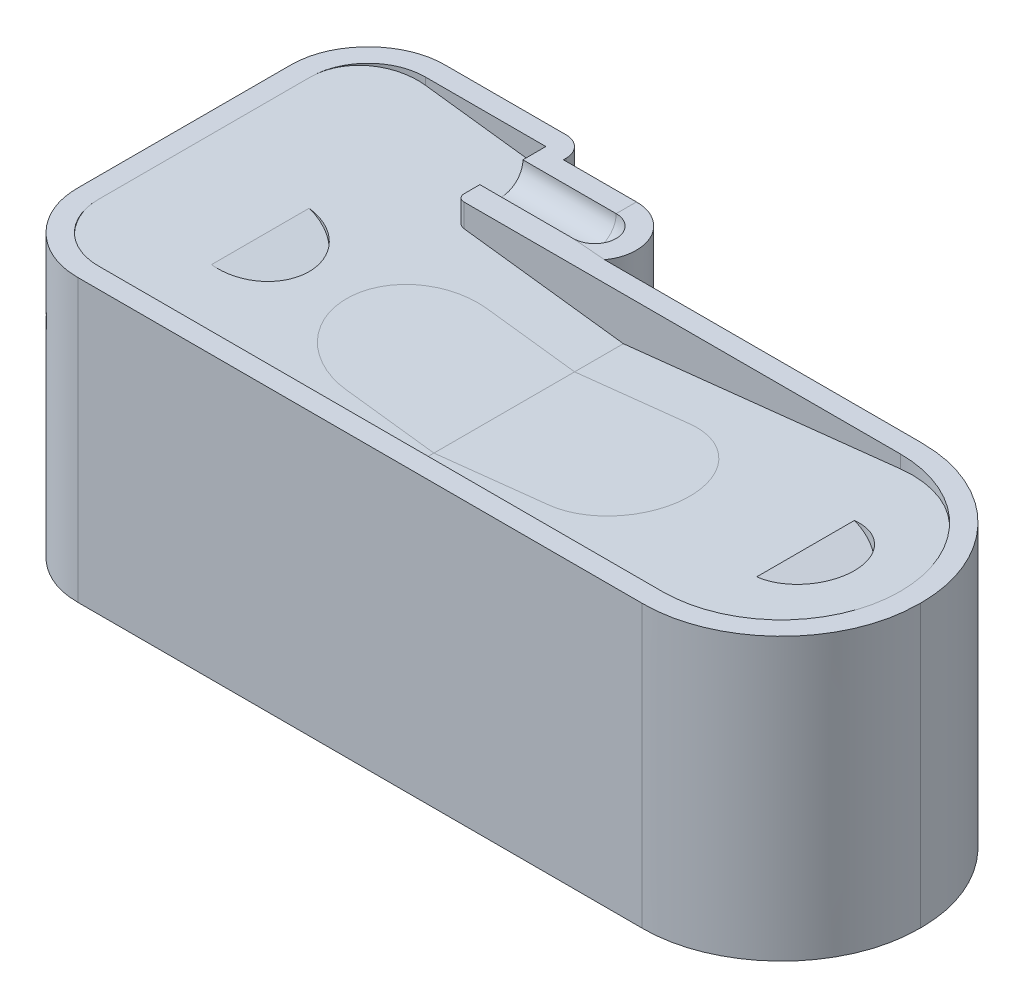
ISO-10303-21;
HEADER;
FILE_DESCRIPTION(('STEP AP214'),'2;1');
FILE_NAME('part.step','',(''),(''),'','','');
FILE_SCHEMA(('AUTOMOTIVE_DESIGN { 1 0 10303 214 1 1 1 1 }'));
ENDSEC;
DATA;
#1=APPLICATION_CONTEXT('core data for automotive mechanical design processes');
#2=APPLICATION_PROTOCOL_DEFINITION('international standard','automotive_design',2000,#1);
#3=PRODUCT_CONTEXT('',#1,'mechanical');
#4=PRODUCT('Part','Part','',(#3));
#5=PRODUCT_RELATED_PRODUCT_CATEGORY('part','',(#4));
#6=PRODUCT_DEFINITION_FORMATION('','',#4);
#7=PRODUCT_DEFINITION_CONTEXT('part definition',#1,'design');
#8=PRODUCT_DEFINITION('design','',#6,#7);
#9=PRODUCT_DEFINITION_SHAPE('','',#8);
#10=(LENGTH_UNIT() NAMED_UNIT(*) SI_UNIT(.MILLI.,.METRE.));
#11=(NAMED_UNIT(*) PLANE_ANGLE_UNIT() SI_UNIT($,.RADIAN.));
#12=(NAMED_UNIT(*) SI_UNIT($,.STERADIAN.) SOLID_ANGLE_UNIT());
#13=UNCERTAINTY_MEASURE_WITH_UNIT(LENGTH_MEASURE(1.E-05),#10,'distance_accuracy_value','');
#14=(GEOMETRIC_REPRESENTATION_CONTEXT(3) GLOBAL_UNCERTAINTY_ASSIGNED_CONTEXT((#13)) GLOBAL_UNIT_ASSIGNED_CONTEXT((#10,
#11,#12)) REPRESENTATION_CONTEXT('',''));
#15=CARTESIAN_POINT('',(0.,0.,0.));
#16=DIRECTION('',(0.,0.,1.));
#17=DIRECTION('',(1.,0.,0.));
#18=AXIS2_PLACEMENT_3D('',#15,#16,#17);
#19=CARTESIAN_POINT('',(-12.444,10.,-7.299));
#20=CARTESIAN_POINT('',(-12.3743071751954,10.,-7.29617606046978));
#21=CARTESIAN_POINT('',(-11.8325128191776,10.,-7.27422265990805));
#22=CARTESIAN_POINT('',(-11.3402534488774,10.,-6.91423830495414));
#23=CARTESIAN_POINT('',(-10.9064674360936,10.,-6.07209550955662));
#24=CARTESIAN_POINT('',(-10.9007100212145,10.,-5.46221551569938));
#25=CARTESIAN_POINT('',(-11.1977209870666,10.,-5.00866481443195));
#26=CARTESIAN_POINT('',(-11.2341734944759,10.,-4.953));
#27=B_SPLINE_CURVE_WITH_KNOTS('',3,(#19,#20,#21,#22,#23,#24,#25,#26),.UNSPECIFIED.,.F.,.F.,(4,1,
2,1,4),(0.,0.0643166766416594,0.5,0.938634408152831,1.),.UNSPECIFIED.);
#28=DIRECTION('',(0.,-1.,0.));
#29=VECTOR('',#28,1.);
#30=SURFACE_OF_LINEAR_EXTRUSION('',#27,#29);
#31=DIRECTION('',(0.,-1.,0.));
#32=VECTOR('',#31,1.);
#33=CARTESIAN_POINT('',(-12.444,10.,-7.299));
#34=LINE('',#33,#32);
#35=CARTESIAN_POINT('',(-12.444,0.,-7.299));
#36=VERTEX_POINT('',#35);
#37=CARTESIAN_POINT('',(-12.444,-10.,-7.299));
#38=VERTEX_POINT('',#37);
#39=EDGE_CURVE('E199',#36,#38,#34,.T.);
#40=ORIENTED_EDGE('',*,*,#39,.F.);
#41=CARTESIAN_POINT('',(-12.444,0.,-7.299));
#42=CARTESIAN_POINT('',(-12.3743071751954,0.,-7.29617606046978));
#43=CARTESIAN_POINT('',(-11.8325128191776,0.,-7.27422265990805));
#44=CARTESIAN_POINT('',(-11.3402534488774,0.,-6.91423830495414));
#45=CARTESIAN_POINT('',(-10.9064674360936,0.,-6.07209550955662));
#46=CARTESIAN_POINT('',(-10.9007100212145,0.,-5.46221551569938));
#47=CARTESIAN_POINT('',(-11.1977209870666,0.,-5.00866481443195));
#48=CARTESIAN_POINT('',(-11.2341734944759,0.,-4.953));
#49=B_SPLINE_CURVE_WITH_KNOTS('',3,(#41,#42,#43,#44,#45,#46,#47,#48),.UNSPECIFIED.,.F.,.F.,(4,1,
2,1,4),(0.,0.0643166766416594,0.5,0.938634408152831,1.),.UNSPECIFIED.);
#50=CARTESIAN_POINT('',(-11.2341734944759,0.,-4.953));
#51=VERTEX_POINT('',#50);
#52=EDGE_CURVE('E216',#36,#51,#49,.T.);
#53=ORIENTED_EDGE('',*,*,#52,.T.);
#54=DIRECTION('',(0.,-1.,0.));
#55=VECTOR('',#54,1.);
#56=CARTESIAN_POINT('',(-11.2341734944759,10.,-4.953));
#57=LINE('',#56,#55);
#58=CARTESIAN_POINT('',(-11.2341734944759,-10.,-4.953));
#59=VERTEX_POINT('',#58);
#60=EDGE_CURVE('E192',#51,#59,#57,.T.);
#61=ORIENTED_EDGE('',*,*,#60,.T.);
#62=CARTESIAN_POINT('',(-11.2341734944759,-10.,-4.953));
#63=CARTESIAN_POINT('',(-11.1977209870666,-10.,-5.00866481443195));
#64=CARTESIAN_POINT('',(-10.9007100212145,-10.,-5.46221551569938));
#65=CARTESIAN_POINT('',(-10.9064674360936,-10.,-6.07209550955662));
#66=CARTESIAN_POINT('',(-11.3402534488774,-10.,-6.91423830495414));
#67=CARTESIAN_POINT('',(-11.8325128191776,-10.,-7.27422265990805));
#68=CARTESIAN_POINT('',(-12.3743071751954,-10.,-7.29617606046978));
#69=CARTESIAN_POINT('',(-12.444,-10.,-7.299));
#70=B_SPLINE_CURVE_WITH_KNOTS('',3,(#62,#63,#64,#65,#66,#67,#68,#69),.UNSPECIFIED.,.F.,.F.,(4,1,
2,1,4),(0.,0.0613655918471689,0.5,0.935683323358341,1.),.UNSPECIFIED.);
#71=EDGE_CURVE('E519',#38,#59,#70,.F.);
#72=ORIENTED_EDGE('',*,*,#71,.F.);
#73=EDGE_LOOP('',(#40,#53,#61,#72));
#74=FACE_BOUND('',#73,.T.);
#75=ADVANCED_FACE('F30',(#74),#30,.T.);
#76=CARTESIAN_POINT('',(-15.759,10.,-8.115));
#77=CARTESIAN_POINT('',(-15.7342948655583,10.,-8.11427988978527));
#78=CARTESIAN_POINT('',(-15.6853493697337,10.,-8.11285321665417));
#79=CARTESIAN_POINT('',(-15.6132718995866,10.,-8.10137302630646));
#80=CARTESIAN_POINT('',(-15.543733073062,10.,-8.08347971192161));
#81=CARTESIAN_POINT('',(-15.477101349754,10.,-8.05889167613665));
#82=CARTESIAN_POINT('',(-15.4137434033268,10.,-8.02815731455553));
#83=CARTESIAN_POINT('',(-15.3540245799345,10.,-7.99160457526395));
#84=CARTESIAN_POINT('',(-15.298679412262,10.,-7.94989532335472));
#85=CARTESIAN_POINT('',(-15.2479761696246,10.,-7.90351662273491));
#86=CARTESIAN_POINT('',(-15.2021554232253,10.,-7.85292978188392));
#87=CARTESIAN_POINT('',(-15.1612211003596,10.,-7.79816536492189));
#88=CARTESIAN_POINT('',(-15.1252995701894,10.,-7.73920969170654));
#89=CARTESIAN_POINT('',(-15.0948716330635,10.,-7.67632949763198));
#90=CARTESIAN_POINT('',(-15.0703861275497,10.,-7.60982039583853));
#91=CARTESIAN_POINT('',(-15.0525684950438,10.,-7.54041928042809));
#92=CARTESIAN_POINT('',(-15.0411375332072,10.,-7.46849234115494));
#93=CARTESIAN_POINT('',(-15.0397169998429,10.,-7.41965177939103));
#94=CARTESIAN_POINT('',(-15.039,10.,-7.395));
#95=B_SPLINE_CURVE_WITH_KNOTS('',3,(#76,#77,#78,#79,#80,#81,#82,#83,#84,#85,#86,#87,#88,#89,#90,
#91,#92,#93,#94),.UNSPECIFIED.,.F.,.F.,(4,1,1,1,1,1,1,1,1,1,1,1,1,1,1,1,4),(0.,
0.065526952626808,0.12982115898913,0.193170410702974,0.255814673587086,0.317951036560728,
0.379740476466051,0.441315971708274,0.501563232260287,0.561813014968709,0.622164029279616,
0.682724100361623,0.744729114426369,0.807241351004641,0.870456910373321,0.93461443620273,1.),.UNSPECIFIED.);
#96=DIRECTION('',(0.,-1.,0.));
#97=VECTOR('',#96,1.);
#98=SURFACE_OF_LINEAR_EXTRUSION('',#95,#97);
#99=CARTESIAN_POINT('',(-15.759,0.,-8.115));
#100=CARTESIAN_POINT('',(-15.7342948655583,0.,-8.11427988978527));
#101=CARTESIAN_POINT('',(-15.6853493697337,0.,-8.11285321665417));
#102=CARTESIAN_POINT('',(-15.6132718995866,0.,-8.10137302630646));
#103=CARTESIAN_POINT('',(-15.543733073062,0.,-8.08347971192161));
#104=CARTESIAN_POINT('',(-15.477101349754,0.,-8.05889167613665));
#105=CARTESIAN_POINT('',(-15.4137434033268,0.,-8.02815731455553));
#106=CARTESIAN_POINT('',(-15.3540245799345,0.,-7.99160457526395));
#107=CARTESIAN_POINT('',(-15.298679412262,0.,-7.94989532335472));
#108=CARTESIAN_POINT('',(-15.2479761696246,0.,-7.90351662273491));
#109=CARTESIAN_POINT('',(-15.2021554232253,0.,-7.85292978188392));
#110=CARTESIAN_POINT('',(-15.1612211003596,0.,-7.79816536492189));
#111=CARTESIAN_POINT('',(-15.1252995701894,0.,-7.73920969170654));
#112=CARTESIAN_POINT('',(-15.0948716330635,0.,-7.67632949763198));
#113=CARTESIAN_POINT('',(-15.0703861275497,0.,-7.60982039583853));
#114=CARTESIAN_POINT('',(-15.0525684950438,0.,-7.54041928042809));
#115=CARTESIAN_POINT('',(-15.0411375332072,0.,-7.46849234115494));
#116=CARTESIAN_POINT('',(-15.0397169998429,0.,-7.41965177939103));
#117=CARTESIAN_POINT('',(-15.039,0.,-7.395));
#118=B_SPLINE_CURVE_WITH_KNOTS('',3,(#99,#100,#101,#102,#103,#104,#105,#106,#107,#108,#109,#110,
#111,#112,#113,#114,#115,#116,#117),.UNSPECIFIED.,.F.,.F.,(4,1,1,1,1,1,1,1,1,1,1,1,1,1,1,1,4),
(0.,0.065526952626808,0.12982115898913,0.193170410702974,0.255814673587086,0.317951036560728,
0.379740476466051,0.441315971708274,0.501563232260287,0.561813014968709,0.622164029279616,
0.682724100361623,0.744729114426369,0.807241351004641,0.870456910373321,0.93461443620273,1.),.UNSPECIFIED.);
#119=CARTESIAN_POINT('',(-15.039,0.,-7.395));
#120=VERTEX_POINT('',#119);
#121=CARTESIAN_POINT('',(-15.759,0.,-8.115));
#122=VERTEX_POINT('',#121);
#123=EDGE_CURVE('E35',#120,#122,#118,.F.);
#124=ORIENTED_EDGE('',*,*,#123,.F.);
#125=DIRECTION('',(0.,-1.,0.));
#126=VECTOR('',#125,1.);
#127=CARTESIAN_POINT('',(-15.039,10.,-7.395));
#128=LINE('',#127,#126);
#129=CARTESIAN_POINT('',(-15.039,-10.,-7.395));
#130=VERTEX_POINT('',#129);
#131=EDGE_CURVE('E200',#120,#130,#128,.T.);
#132=ORIENTED_EDGE('',*,*,#131,.T.);
#133=CARTESIAN_POINT('',(-15.759,-10.,-8.115));
#134=CARTESIAN_POINT('',(-15.7342948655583,-10.,-8.11427988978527));
#135=CARTESIAN_POINT('',(-15.6853493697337,-10.,-8.11285321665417));
#136=CARTESIAN_POINT('',(-15.6132718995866,-10.,-8.10137302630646));
#137=CARTESIAN_POINT('',(-15.543733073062,-10.,-8.08347971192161));
#138=CARTESIAN_POINT('',(-15.477101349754,-10.,-8.05889167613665));
#139=CARTESIAN_POINT('',(-15.4137434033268,-10.,-8.02815731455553));
#140=CARTESIAN_POINT('',(-15.3540245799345,-10.,-7.99160457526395));
#141=CARTESIAN_POINT('',(-15.298679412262,-10.,-7.94989532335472));
#142=CARTESIAN_POINT('',(-15.2479761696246,-10.,-7.90351662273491));
#143=CARTESIAN_POINT('',(-15.2021554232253,-10.,-7.85292978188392));
#144=CARTESIAN_POINT('',(-15.1612211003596,-10.,-7.79816536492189));
#145=CARTESIAN_POINT('',(-15.1252995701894,-10.,-7.73920969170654));
#146=CARTESIAN_POINT('',(-15.0948716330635,-10.,-7.67632949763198));
#147=CARTESIAN_POINT('',(-15.0703861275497,-10.,-7.60982039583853));
#148=CARTESIAN_POINT('',(-15.0525684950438,-10.,-7.54041928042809));
#149=CARTESIAN_POINT('',(-15.0411375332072,-10.,-7.46849234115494));
#150=CARTESIAN_POINT('',(-15.0397169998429,-10.,-7.41965177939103));
#151=CARTESIAN_POINT('',(-15.039,-10.,-7.395));
#152=B_SPLINE_CURVE_WITH_KNOTS('',3,(#133,#134,#135,#136,#137,#138,#139,#140,#141,#142,#143,
#144,#145,#146,#147,#148,#149,#150,#151),.UNSPECIFIED.,.F.,.F.,(4,1,1,1,1,1,1,1,1,1,1,1,1,1,1,1,
4),(0.,0.065526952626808,0.12982115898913,0.193170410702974,0.255814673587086,0.317951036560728,
0.379740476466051,0.441315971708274,0.501563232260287,0.561813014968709,0.622164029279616,
0.682724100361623,0.744729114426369,0.807241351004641,0.870456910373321,0.93461443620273,1.),.UNSPECIFIED.);
#153=CARTESIAN_POINT('',(-15.759,-10.,-8.115));
#154=VERTEX_POINT('',#153);
#155=EDGE_CURVE('E429',#154,#130,#152,.T.);
#156=ORIENTED_EDGE('',*,*,#155,.F.);
#157=DIRECTION('',(0.,-1.,0.));
#158=VECTOR('',#157,1.);
#159=CARTESIAN_POINT('',(-15.759,10.,-8.115));
#160=LINE('',#159,#158);
#161=EDGE_CURVE('E217',#122,#154,#160,.T.);
#162=ORIENTED_EDGE('',*,*,#161,.F.);
#163=EDGE_LOOP('',(#124,#132,#156,#162));
#164=FACE_BOUND('',#163,.T.);
#165=ADVANCED_FACE('F32',(#164),#98,.T.);
#166=CARTESIAN_POINT('',(-20.043,10.,-8.115));
#167=DIRECTION('',(0.,0.,-1.));
#168=DIRECTION('',(-1.,0.,0.));
#169=AXIS2_PLACEMENT_3D('',#166,#167,#168);
#170=PLANE('',#169);
#171=DIRECTION('',(-1.,0.,0.));
#172=VECTOR('',#171,1.);
#173=CARTESIAN_POINT('',(-20.043,0.,-8.115));
#174=LINE('',#173,#172);
#175=CARTESIAN_POINT('',(-20.043,0.,-8.115));
#176=VERTEX_POINT('',#175);
#177=EDGE_CURVE('E261',#122,#176,#174,.T.);
#178=ORIENTED_EDGE('',*,*,#177,.F.);
#179=ORIENTED_EDGE('',*,*,#161,.T.);
#180=DIRECTION('',(1.,0.,0.));
#181=VECTOR('',#180,1.);
#182=CARTESIAN_POINT('',(-20.043,-10.,-8.115));
#183=LINE('',#182,#181);
#184=CARTESIAN_POINT('',(-20.043,-10.,-8.115));
#185=VERTEX_POINT('',#184);
#186=EDGE_CURVE('E203',#185,#154,#183,.T.);
#187=ORIENTED_EDGE('',*,*,#186,.F.);
#188=DIRECTION('',(0.,-1.,0.));
#189=VECTOR('',#188,1.);
#190=CARTESIAN_POINT('',(-20.043,10.,-8.115));
#191=LINE('',#190,#189);
#192=EDGE_CURVE('E574',#176,#185,#191,.T.);
#193=ORIENTED_EDGE('',*,*,#192,.F.);
#194=EDGE_LOOP('',(#178,#179,#187,#193));
#195=FACE_BOUND('',#194,.T.);
#196=ADVANCED_FACE('F550',(#195),#170,.T.);
#197=CARTESIAN_POINT('',(-22.803,10.,-5.35499999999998));
#198=CARTESIAN_POINT('',(-22.800289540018,10.,-5.44806484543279));
#199=CARTESIAN_POINT('',(-22.789615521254,10.,-5.81456201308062));
#200=CARTESIAN_POINT('',(-22.5140716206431,10.,-6.87078707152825));
#201=CARTESIAN_POINT('',(-21.5587870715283,10.,-7.82607162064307));
#202=CARTESIAN_POINT('',(-20.5025620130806,10.,-8.10161552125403));
#203=CARTESIAN_POINT('',(-20.1360648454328,10.,-8.11228954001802));
#204=CARTESIAN_POINT('',(-20.043,10.,-8.115));
#205=B_SPLINE_CURVE_WITH_KNOTS('',3,(#197,#198,#199,#200,#201,#202,#203,#204),.UNSPECIFIED.,.F.,
.F.,(4,1,1,1,1,4),(0.,0.0644955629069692,0.253988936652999,0.746011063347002,0.93550443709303,
1.),.UNSPECIFIED.);
#206=DIRECTION('',(0.,-1.,0.));
#207=VECTOR('',#206,1.);
#208=SURFACE_OF_LINEAR_EXTRUSION('',#205,#207);
#209=CARTESIAN_POINT('',(-22.803,0.,-5.35499999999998));
#210=CARTESIAN_POINT('',(-22.800289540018,0.,-5.44806484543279));
#211=CARTESIAN_POINT('',(-22.789615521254,0.,-5.81456201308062));
#212=CARTESIAN_POINT('',(-22.5140716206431,0.,-6.87078707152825));
#213=CARTESIAN_POINT('',(-21.5587870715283,0.,-7.82607162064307));
#214=CARTESIAN_POINT('',(-20.5025620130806,0.,-8.10161552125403));
#215=CARTESIAN_POINT('',(-20.1360648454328,0.,-8.11228954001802));
#216=CARTESIAN_POINT('',(-20.043,0.,-8.115));
#217=B_SPLINE_CURVE_WITH_KNOTS('',3,(#209,#210,#211,#212,#213,#214,#215,#216),.UNSPECIFIED.,.F.,
.F.,(4,1,1,1,1,4),(0.,0.0644955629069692,0.253988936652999,0.746011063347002,0.93550443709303,
1.),.UNSPECIFIED.);
#218=CARTESIAN_POINT('',(-22.803,0.,-5.35499999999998));
#219=VERTEX_POINT('',#218);
#220=EDGE_CURVE('E257',#176,#219,#217,.F.);
#221=ORIENTED_EDGE('',*,*,#220,.F.);
#222=ORIENTED_EDGE('',*,*,#192,.T.);
#223=CARTESIAN_POINT('',(-22.803,-10.,-5.35499999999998));
#224=CARTESIAN_POINT('',(-22.800289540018,-10.,-5.44806484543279));
#225=CARTESIAN_POINT('',(-22.789615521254,-10.,-5.81456201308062));
#226=CARTESIAN_POINT('',(-22.5140716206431,-10.,-6.87078707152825));
#227=CARTESIAN_POINT('',(-21.5587870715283,-10.,-7.82607162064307));
#228=CARTESIAN_POINT('',(-20.5025620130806,-10.,-8.10161552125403));
#229=CARTESIAN_POINT('',(-20.1360648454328,-10.,-8.11228954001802));
#230=CARTESIAN_POINT('',(-20.043,-10.,-8.115));
#231=B_SPLINE_CURVE_WITH_KNOTS('',3,(#223,#224,#225,#226,#227,#228,#229,#230),.UNSPECIFIED.,.F.,
.F.,(4,1,1,1,1,4),(0.,0.0644955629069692,0.253988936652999,0.746011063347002,0.93550443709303,
1.),.UNSPECIFIED.);
#232=CARTESIAN_POINT('',(-22.803,-10.,-5.35499999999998));
#233=VERTEX_POINT('',#232);
#234=EDGE_CURVE('E469',#233,#185,#231,.T.);
#235=ORIENTED_EDGE('',*,*,#234,.F.);
#236=DIRECTION('',(0.,-1.,0.));
#237=VECTOR('',#236,1.);
#238=CARTESIAN_POINT('',(-22.803,10.,-5.35499999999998));
#239=LINE('',#238,#237);
#240=EDGE_CURVE('E577',#219,#233,#239,.T.);
#241=ORIENTED_EDGE('',*,*,#240,.F.);
#242=EDGE_LOOP('',(#221,#222,#235,#241));
#243=FACE_BOUND('',#242,.T.);
#244=ADVANCED_FACE('F553',(#243),#208,.T.);
#245=CARTESIAN_POINT('',(-22.803,10.,2.193));
#246=DIRECTION('',(-1.,0.,0.));
#247=DIRECTION('',(0.,0.,1.));
#248=AXIS2_PLACEMENT_3D('',#245,#246,#247);
#249=PLANE('',#248);
#250=DIRECTION('',(0.,0.,1.));
#251=VECTOR('',#250,1.);
#252=CARTESIAN_POINT('',(-22.803,0.,2.193));
#253=LINE('',#252,#251);
#254=CARTESIAN_POINT('',(-22.803,0.,2.193));
#255=VERTEX_POINT('',#254);
#256=EDGE_CURVE('E251',#219,#255,#253,.T.);
#257=ORIENTED_EDGE('',*,*,#256,.F.);
#258=ORIENTED_EDGE('',*,*,#240,.T.);
#259=DIRECTION('',(0.,0.,-1.));
#260=VECTOR('',#259,1.);
#261=CARTESIAN_POINT('',(-22.803,-10.,2.193));
#262=LINE('',#261,#260);
#263=CARTESIAN_POINT('',(-22.803,-10.,2.193));
#264=VERTEX_POINT('',#263);
#265=EDGE_CURVE('E463',#264,#233,#262,.T.);
#266=ORIENTED_EDGE('',*,*,#265,.F.);
#267=DIRECTION('',(0.,-1.,0.));
#268=VECTOR('',#267,1.);
#269=CARTESIAN_POINT('',(-22.803,10.,2.193));
#270=LINE('',#269,#268);
#271=EDGE_CURVE('E580',#255,#264,#270,.T.);
#272=ORIENTED_EDGE('',*,*,#271,.F.);
#273=EDGE_LOOP('',(#257,#258,#266,#272));
#274=FACE_BOUND('',#273,.T.);
#275=ADVANCED_FACE('F558',(#274),#249,.T.);
#276=CARTESIAN_POINT('',(-20.043,10.,4.953));
#277=CARTESIAN_POINT('',(-20.1360648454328,10.,4.95028954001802));
#278=CARTESIAN_POINT('',(-20.5025620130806,10.,4.93961552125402));
#279=CARTESIAN_POINT('',(-21.5587870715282,10.,4.66407162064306));
#280=CARTESIAN_POINT('',(-22.5140716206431,10.,3.70878707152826));
#281=CARTESIAN_POINT('',(-22.789615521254,10.,2.65256201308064));
#282=CARTESIAN_POINT('',(-22.800289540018,10.,2.28606484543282));
#283=CARTESIAN_POINT('',(-22.803,10.,2.193));
#284=B_SPLINE_CURVE_WITH_KNOTS('',3,(#276,#277,#278,#279,#280,#281,#282,#283),.UNSPECIFIED.,.F.,
.F.,(4,1,1,1,1,4),(0.,0.0644955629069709,0.253988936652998,0.746011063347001,0.935504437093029,
1.),.UNSPECIFIED.);
#285=DIRECTION('',(0.,-1.,0.));
#286=VECTOR('',#285,1.);
#287=SURFACE_OF_LINEAR_EXTRUSION('',#284,#286);
#288=CARTESIAN_POINT('',(-20.043,0.,4.953));
#289=CARTESIAN_POINT('',(-20.1360648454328,0.,4.95028954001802));
#290=CARTESIAN_POINT('',(-20.5025620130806,0.,4.93961552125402));
#291=CARTESIAN_POINT('',(-21.5587870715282,0.,4.66407162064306));
#292=CARTESIAN_POINT('',(-22.5140716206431,0.,3.70878707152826));
#293=CARTESIAN_POINT('',(-22.789615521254,0.,2.65256201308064));
#294=CARTESIAN_POINT('',(-22.800289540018,0.,2.28606484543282));
#295=CARTESIAN_POINT('',(-22.803,0.,2.193));
#296=B_SPLINE_CURVE_WITH_KNOTS('',3,(#288,#289,#290,#291,#292,#293,#294,#295),.UNSPECIFIED.,.F.,
.F.,(4,1,1,1,1,4),(0.,0.0644955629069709,0.253988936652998,0.746011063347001,0.935504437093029,
1.),.UNSPECIFIED.);
#297=CARTESIAN_POINT('',(-20.043,0.,4.953));
#298=VERTEX_POINT('',#297);
#299=EDGE_CURVE('E246',#255,#298,#296,.F.);
#300=ORIENTED_EDGE('',*,*,#299,.F.);
#301=ORIENTED_EDGE('',*,*,#271,.T.);
#302=CARTESIAN_POINT('',(-20.043,-10.,4.953));
#303=CARTESIAN_POINT('',(-20.1360648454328,-10.,4.95028954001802));
#304=CARTESIAN_POINT('',(-20.5025620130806,-10.,4.93961552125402));
#305=CARTESIAN_POINT('',(-21.5587870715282,-10.,4.66407162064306));
#306=CARTESIAN_POINT('',(-22.5140716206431,-10.,3.70878707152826));
#307=CARTESIAN_POINT('',(-22.789615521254,-10.,2.65256201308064));
#308=CARTESIAN_POINT('',(-22.800289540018,-10.,2.28606484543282));
#309=CARTESIAN_POINT('',(-22.803,-10.,2.193));
#310=B_SPLINE_CURVE_WITH_KNOTS('',3,(#302,#303,#304,#305,#306,#307,#308,#309),.UNSPECIFIED.,.F.,
.F.,(4,1,1,1,1,4),(0.,0.0644955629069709,0.253988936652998,0.746011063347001,0.935504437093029,
1.),.UNSPECIFIED.);
#311=CARTESIAN_POINT('',(-20.043,-10.,4.953));
#312=VERTEX_POINT('',#311);
#313=EDGE_CURVE('E458',#312,#264,#310,.T.);
#314=ORIENTED_EDGE('',*,*,#313,.F.);
#315=DIRECTION('',(0.,-1.,0.));
#316=VECTOR('',#315,1.);
#317=CARTESIAN_POINT('',(-20.043,10.,4.953));
#318=LINE('',#317,#316);
#319=EDGE_CURVE('E190',#298,#312,#318,.T.);
#320=ORIENTED_EDGE('',*,*,#319,.F.);
#321=EDGE_LOOP('',(#300,#301,#314,#320));
#322=FACE_BOUND('',#321,.T.);
#323=ADVANCED_FACE('F594',(#322),#287,.T.);
#324=CARTESIAN_POINT('',(0.,10.,4.953));
#325=DIRECTION('',(0.,0.,1.));
#326=DIRECTION('',(1.,0.,0.));
#327=AXIS2_PLACEMENT_3D('',#324,#325,#326);
#328=PLANE('',#327);
#329=DIRECTION('',(1.,0.,0.));
#330=VECTOR('',#329,1.);
#331=CARTESIAN_POINT('',(0.,0.,4.953));
#332=LINE('',#331,#330);
#333=CARTESIAN_POINT('',(0.,0.,4.953));
#334=VERTEX_POINT('',#333);
#335=EDGE_CURVE('E164',#298,#334,#332,.T.);
#336=ORIENTED_EDGE('',*,*,#335,.F.);
#337=ORIENTED_EDGE('',*,*,#319,.T.);
#338=DIRECTION('',(-1.,0.,0.));
#339=VECTOR('',#338,1.);
#340=CARTESIAN_POINT('',(0.,-10.,4.953));
#341=LINE('',#340,#339);
#342=CARTESIAN_POINT('',(0.,-10.,4.953));
#343=VERTEX_POINT('',#342);
#344=EDGE_CURVE('E452',#343,#312,#341,.T.);
#345=ORIENTED_EDGE('',*,*,#344,.F.);
#346=DIRECTION('',(0.,-1.,0.));
#347=VECTOR('',#346,1.);
#348=CARTESIAN_POINT('',(0.,10.,4.953));
#349=LINE('',#348,#347);
#350=EDGE_CURVE('E188',#334,#343,#349,.T.);
#351=ORIENTED_EDGE('',*,*,#350,.F.);
#352=EDGE_LOOP('',(#336,#337,#345,#351));
#353=FACE_BOUND('',#352,.T.);
#354=ADVANCED_FACE('F588',(#353),#328,.T.);
#355=CARTESIAN_POINT('',(4.953,10.,0.));
#356=CARTESIAN_POINT('',(4.9480812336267,10.,0.168575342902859));
#357=CARTESIAN_POINT('',(4.91488975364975,10.,1.30610957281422));
#358=CARTESIAN_POINT('',(4.04211058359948,10.,3.31683289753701));
#359=CARTESIAN_POINT('',(2.09924400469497,10.,4.63646710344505));
#360=CARTESIAN_POINT('',(0.665901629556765,10.,4.93357002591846));
#361=CARTESIAN_POINT('',(0.168575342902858,10.,4.9480812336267));
#362=CARTESIAN_POINT('',(0.,10.,4.953));
#363=B_SPLINE_CURVE_WITH_KNOTS('',3,(#355,#356,#357,#358,#359,#360,#361,#362),.UNSPECIFIED.,.F.,
.F.,(4,1,1,1,1,4),(0.,0.0650245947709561,0.438781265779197,0.808166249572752,0.934975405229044,
1.),.UNSPECIFIED.);
#364=DIRECTION('',(0.,-1.,0.));
#365=VECTOR('',#364,1.);
#366=SURFACE_OF_LINEAR_EXTRUSION('',#363,#365);
#367=CARTESIAN_POINT('',(4.953,0.,0.));
#368=CARTESIAN_POINT('',(4.9480812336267,0.,0.168575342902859));
#369=CARTESIAN_POINT('',(4.91488975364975,0.,1.30610957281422));
#370=CARTESIAN_POINT('',(4.04211058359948,0.,3.31683289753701));
#371=CARTESIAN_POINT('',(2.09924400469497,0.,4.63646710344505));
#372=CARTESIAN_POINT('',(0.665901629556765,0.,4.93357002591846));
#373=CARTESIAN_POINT('',(0.168575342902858,0.,4.9480812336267));
#374=CARTESIAN_POINT('',(0.,0.,4.953));
#375=B_SPLINE_CURVE_WITH_KNOTS('',3,(#367,#368,#369,#370,#371,#372,#373,#374),.UNSPECIFIED.,.F.,
.F.,(4,1,1,1,1,4),(0.,0.0650245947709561,0.438781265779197,0.808166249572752,0.934975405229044,
1.),.UNSPECIFIED.);
#376=CARTESIAN_POINT('',(4.953,0.,0.));
#377=VERTEX_POINT('',#376);
#378=EDGE_CURVE('E157',#334,#377,#375,.F.);
#379=ORIENTED_EDGE('',*,*,#378,.F.);
#380=ORIENTED_EDGE('',*,*,#350,.T.);
#381=CARTESIAN_POINT('',(4.953,-10.,0.));
#382=CARTESIAN_POINT('',(4.9480812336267,-10.,0.168575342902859));
#383=CARTESIAN_POINT('',(4.91488975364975,-10.,1.30610957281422));
#384=CARTESIAN_POINT('',(4.04211058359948,-10.,3.31683289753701));
#385=CARTESIAN_POINT('',(2.09924400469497,-10.,4.63646710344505));
#386=CARTESIAN_POINT('',(0.665901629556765,-10.,4.93357002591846));
#387=CARTESIAN_POINT('',(0.168575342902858,-10.,4.9480812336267));
#388=CARTESIAN_POINT('',(0.,-10.,4.953));
#389=B_SPLINE_CURVE_WITH_KNOTS('',3,(#381,#382,#383,#384,#385,#386,#387,#388),.UNSPECIFIED.,.F.,
.F.,(4,1,1,1,1,4),(0.,0.0650245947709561,0.438781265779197,0.808166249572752,0.934975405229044,
1.),.UNSPECIFIED.);
#390=CARTESIAN_POINT('',(4.953,-10.,0.));
#391=VERTEX_POINT('',#390);
#392=EDGE_CURVE('E186',#391,#343,#389,.T.);
#393=ORIENTED_EDGE('',*,*,#392,.F.);
#394=DIRECTION('',(0.,-1.,0.));
#395=VECTOR('',#394,1.);
#396=CARTESIAN_POINT('',(4.953,10.,0.));
#397=LINE('',#396,#395);
#398=EDGE_CURVE('E177',#377,#391,#397,.T.);
#399=ORIENTED_EDGE('',*,*,#398,.F.);
#400=EDGE_LOOP('',(#379,#380,#393,#399));
#401=FACE_BOUND('',#400,.T.);
#402=ADVANCED_FACE('F184',(#401),#366,.T.);
#403=CARTESIAN_POINT('',(0.,10.,-4.953));
#404=CARTESIAN_POINT('',(0.168575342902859,10.,-4.9480812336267));
#405=CARTESIAN_POINT('',(1.30610957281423,10.,-4.91488975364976));
#406=CARTESIAN_POINT('',(3.31683289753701,10.,-4.04211058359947));
#407=CARTESIAN_POINT('',(4.63646710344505,10.,-2.09924400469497));
#408=CARTESIAN_POINT('',(4.93357002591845,10.,-0.665901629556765));
#409=CARTESIAN_POINT('',(4.9480812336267,10.,-0.168575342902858));
#410=CARTESIAN_POINT('',(4.953,10.,0.));
#411=B_SPLINE_CURVE_WITH_KNOTS('',3,(#403,#404,#405,#406,#407,#408,#409,#410),.UNSPECIFIED.,.F.,
.F.,(4,1,1,1,1,4),(0.,0.065024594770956,0.438781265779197,0.808166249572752,0.934975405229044,
1.),.UNSPECIFIED.);
#412=DIRECTION('',(0.,-1.,0.));
#413=VECTOR('',#412,1.);
#414=SURFACE_OF_LINEAR_EXTRUSION('',#411,#413);
#415=CARTESIAN_POINT('',(0.,0.,-4.953));
#416=CARTESIAN_POINT('',(0.168575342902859,0.,-4.9480812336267));
#417=CARTESIAN_POINT('',(1.30610957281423,0.,-4.91488975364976));
#418=CARTESIAN_POINT('',(3.31683289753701,0.,-4.04211058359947));
#419=CARTESIAN_POINT('',(4.63646710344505,0.,-2.09924400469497));
#420=CARTESIAN_POINT('',(4.93357002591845,0.,-0.665901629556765));
#421=CARTESIAN_POINT('',(4.9480812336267,0.,-0.168575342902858));
#422=CARTESIAN_POINT('',(4.953,0.,0.));
#423=B_SPLINE_CURVE_WITH_KNOTS('',3,(#415,#416,#417,#418,#419,#420,#421,#422),.UNSPECIFIED.,.F.,
.F.,(4,1,1,1,1,4),(0.,0.065024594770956,0.438781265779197,0.808166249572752,0.934975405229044,
1.),.UNSPECIFIED.);
#424=CARTESIAN_POINT('',(0.,0.,-4.953));
#425=VERTEX_POINT('',#424);
#426=EDGE_CURVE('E161',#377,#425,#423,.F.);
#427=ORIENTED_EDGE('',*,*,#426,.F.);
#428=ORIENTED_EDGE('',*,*,#398,.T.);
#429=CARTESIAN_POINT('',(0.,-10.,-4.953));
#430=CARTESIAN_POINT('',(0.168575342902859,-10.,-4.9480812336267));
#431=CARTESIAN_POINT('',(1.30610957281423,-10.,-4.91488975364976));
#432=CARTESIAN_POINT('',(3.31683289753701,-10.,-4.04211058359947));
#433=CARTESIAN_POINT('',(4.63646710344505,-10.,-2.09924400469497));
#434=CARTESIAN_POINT('',(4.93357002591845,-10.,-0.665901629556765));
#435=CARTESIAN_POINT('',(4.9480812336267,-10.,-0.168575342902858));
#436=CARTESIAN_POINT('',(4.953,-10.,0.));
#437=B_SPLINE_CURVE_WITH_KNOTS('',3,(#429,#430,#431,#432,#433,#434,#435,#436),.UNSPECIFIED.,.F.,
.F.,(4,1,1,1,1,4),(0.,0.065024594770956,0.438781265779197,0.808166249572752,0.934975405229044,
1.),.UNSPECIFIED.);
#438=CARTESIAN_POINT('',(0.,-10.,-4.953));
#439=VERTEX_POINT('',#438);
#440=EDGE_CURVE('E441',#439,#391,#437,.T.);
#441=ORIENTED_EDGE('',*,*,#440,.F.);
#442=DIRECTION('',(0.,-1.,0.));
#443=VECTOR('',#442,1.);
#444=CARTESIAN_POINT('',(0.,10.,-4.953));
#445=LINE('',#444,#443);
#446=EDGE_CURVE('E180',#425,#439,#445,.T.);
#447=ORIENTED_EDGE('',*,*,#446,.F.);
#448=EDGE_LOOP('',(#427,#428,#441,#447));
#449=FACE_BOUND('',#448,.T.);
#450=ADVANCED_FACE('F174',(#449),#414,.T.);
#451=CARTESIAN_POINT('',(-11.2341734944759,10.,-4.953));
#452=DIRECTION('',(0.,0.,-1.));
#453=DIRECTION('',(-1.,0.,0.));
#454=AXIS2_PLACEMENT_3D('',#451,#452,#453);
#455=PLANE('',#454);
#456=DIRECTION('',(-1.,0.,0.));
#457=VECTOR('',#456,1.);
#458=CARTESIAN_POINT('',(-11.2341734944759,0.,-4.953));
#459=LINE('',#458,#457);
#460=EDGE_CURVE('E182',#425,#51,#459,.T.);
#461=ORIENTED_EDGE('',*,*,#460,.F.);
#462=ORIENTED_EDGE('',*,*,#446,.T.);
#463=DIRECTION('',(1.,0.,0.));
#464=VECTOR('',#463,1.);
#465=CARTESIAN_POINT('',(-11.2341734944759,-10.,-4.953));
#466=LINE('',#465,#464);
#467=EDGE_CURVE('E445',#59,#439,#466,.T.);
#468=ORIENTED_EDGE('',*,*,#467,.F.);
#469=ORIENTED_EDGE('',*,*,#60,.F.);
#470=EDGE_LOOP('',(#461,#462,#468,#469));
#471=FACE_BOUND('',#470,.T.);
#472=ADVANCED_FACE('F502',(#471),#455,.T.);
#473=CARTESIAN_POINT('',(-15.039,10.,-7.299));
#474=DIRECTION('',(0.,0.,-1.));
#475=DIRECTION('',(-1.,0.,0.));
#476=AXIS2_PLACEMENT_3D('',#473,#474,#475);
#477=PLANE('',#476);
#478=DIRECTION('',(-1.,0.,0.));
#479=VECTOR('',#478,1.);
#480=CARTESIAN_POINT('',(-15.039,0.,-7.299));
#481=LINE('',#480,#479);
#482=CARTESIAN_POINT('',(-15.039,0.,-7.299));
#483=VERTEX_POINT('',#482);
#484=EDGE_CURVE('E213',#36,#483,#481,.T.);
#485=ORIENTED_EDGE('',*,*,#484,.F.);
#486=ORIENTED_EDGE('',*,*,#39,.T.);
#487=DIRECTION('',(1.,0.,0.));
#488=VECTOR('',#487,1.);
#489=CARTESIAN_POINT('',(-15.039,-10.,-7.299));
#490=LINE('',#489,#488);
#491=CARTESIAN_POINT('',(-15.039,-10.,-7.299));
#492=VERTEX_POINT('',#491);
#493=EDGE_CURVE('E440',#492,#38,#490,.T.);
#494=ORIENTED_EDGE('',*,*,#493,.F.);
#495=DIRECTION('',(0.,-1.,0.));
#496=VECTOR('',#495,1.);
#497=CARTESIAN_POINT('',(-15.039,10.,-7.299));
#498=LINE('',#497,#496);
#499=EDGE_CURVE('E196',#483,#492,#498,.T.);
#500=ORIENTED_EDGE('',*,*,#499,.F.);
#501=EDGE_LOOP('',(#485,#486,#494,#500));
#502=FACE_BOUND('',#501,.T.);
#503=ADVANCED_FACE('F504',(#502),#477,.T.);
#504=CARTESIAN_POINT('',(-15.039,10.,-7.395));
#505=DIRECTION('',(1.,0.,0.));
#506=DIRECTION('',(0.,0.,-1.));
#507=AXIS2_PLACEMENT_3D('',#504,#505,#506);
#508=PLANE('',#507);
#509=DIRECTION('',(0.,0.,-1.));
#510=VECTOR('',#509,1.);
#511=CARTESIAN_POINT('',(-15.039,0.,-7.395));
#512=LINE('',#511,#510);
#513=EDGE_CURVE('E152',#483,#120,#512,.T.);
#514=ORIENTED_EDGE('',*,*,#513,.F.);
#515=ORIENTED_EDGE('',*,*,#499,.T.);
#516=DIRECTION('',(0.,0.,1.));
#517=VECTOR('',#516,1.);
#518=CARTESIAN_POINT('',(-15.039,-10.,-7.395));
#519=LINE('',#518,#517);
#520=EDGE_CURVE('E434',#130,#492,#519,.T.);
#521=ORIENTED_EDGE('',*,*,#520,.F.);
#522=ORIENTED_EDGE('',*,*,#131,.F.);
#523=EDGE_LOOP('',(#514,#515,#521,#522));
#524=FACE_BOUND('',#523,.T.);
#525=ADVANCED_FACE('F547',(#524),#508,.T.);
#526=CARTESIAN_POINT('',(-15.2499819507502,-10.,-7.90401605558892));
#527=DIRECTION('',(0.,1.,0.));
#528=DIRECTION('',(0.,0.,1.));
#529=AXIS2_PLACEMENT_3D('',#526,#527,#528);
#530=PLANE('',#529);
#531=ORIENTED_EDGE('',*,*,#155,.T.);
#532=ORIENTED_EDGE('',*,*,#520,.T.);
#533=ORIENTED_EDGE('',*,*,#493,.T.);
#534=ORIENTED_EDGE('',*,*,#71,.T.);
#535=ORIENTED_EDGE('',*,*,#467,.T.);
#536=ORIENTED_EDGE('',*,*,#440,.T.);
#537=ORIENTED_EDGE('',*,*,#392,.T.);
#538=ORIENTED_EDGE('',*,*,#344,.T.);
#539=ORIENTED_EDGE('',*,*,#313,.T.);
#540=ORIENTED_EDGE('',*,*,#265,.T.);
#541=ORIENTED_EDGE('',*,*,#234,.T.);
#542=ORIENTED_EDGE('',*,*,#186,.T.);
#543=EDGE_LOOP('',(#531,#532,#533,#534,#535,#536,#537,#538,#539,#540,#541,#542));
#544=FACE_BOUND('',#543,.T.);
#545=ADVANCED_FACE('F529',(#544),#530,.F.);
#546=CARTESIAN_POINT('',(0.867000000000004,-0.365869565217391,38.9801952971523));
#547=DIRECTION('',(0.352958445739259,0.935638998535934,0.));
#548=DIRECTION('',(-0.935638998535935,0.352958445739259,0.));
#549=AXIS2_PLACEMENT_3D('',#546,#547,#548);
#550=PLANE('',#549);
#551=CARTESIAN_POINT('',(0.867000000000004,-0.365869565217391,0.));
#552=DIRECTION('',(0.352958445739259,0.935638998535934,0.));
#553=DIRECTION('',(0.935638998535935,-0.352958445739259,0.));
#554=AXIS2_PLACEMENT_3D('',#551,#552,#553);
#555=ELLIPSE('',#554,1.85327888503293,1.734);
#556=CARTESIAN_POINT('',(0.867000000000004,-0.365869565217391,1.73400000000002));
#557=VERTEX_POINT('',#556);
#558=CARTESIAN_POINT('',(0.867000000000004,-0.365869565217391,-1.73399999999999));
#559=VERTEX_POINT('',#558);
#560=EDGE_CURVE('E279',#557,#559,#555,.T.);
#561=ORIENTED_EDGE('',*,*,#560,.T.);
#562=DIRECTION('',(0.,0.,-1.));
#563=VECTOR('',#562,1.);
#564=CARTESIAN_POINT('',(0.867000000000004,-0.365869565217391,38.9801952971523));
#565=LINE('',#564,#563);
#566=EDGE_CURVE('E274',#557,#559,#565,.T.);
#567=ORIENTED_EDGE('',*,*,#566,.F.);
#568=EDGE_LOOP('',(#561,#567));
#569=FACE_BOUND('',#568,.T.);
#570=ADVANCED_FACE('F546',(#569),#550,.T.);
#571=CARTESIAN_POINT('',(0.867000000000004,2.04,0.));
#572=DIRECTION('',(0.,-1.,0.));
#573=DIRECTION('',(0.,0.,-1.));
#574=AXIS2_PLACEMENT_3D('',#571,#572,#573);
#575=CYLINDRICAL_SURFACE('',#574,1.734);
#576=CARTESIAN_POINT('',(0.867000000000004,-0.365869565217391,0.));
#577=DIRECTION('',(0.108059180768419,-0.994144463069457,0.));
#578=DIRECTION('',(-0.994144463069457,-0.108059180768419,0.));
#579=AXIS2_PLACEMENT_3D('',#576,#577,#578);
#580=ELLIPSE('',#579,1.74421330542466,1.734);
#581=EDGE_CURVE('E289',#557,#559,#580,.F.);
#582=ORIENTED_EDGE('',*,*,#581,.T.);
#583=ORIENTED_EDGE('',*,*,#560,.F.);
#584=EDGE_LOOP('',(#582,#583));
#585=FACE_BOUND('',#584,.T.);
#586=ADVANCED_FACE('F785',(#585),#575,.F.);
#587=CARTESIAN_POINT('',(-18.513,2.04,0.));
#588=DIRECTION('',(0.,-1.,0.));
#589=DIRECTION('',(0.,0.,-1.));
#590=AXIS2_PLACEMENT_3D('',#587,#588,#589);
#591=CYLINDRICAL_SURFACE('',#590,1.734);
#592=CARTESIAN_POINT('',(-18.513,-0.44625,0.));
#593=DIRECTION('',(-0.124034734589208,-0.992277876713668,0.));
#594=DIRECTION('',(0.992277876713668,-0.124034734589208,0.));
#595=AXIS2_PLACEMENT_3D('',#592,#593,#594);
#596=ELLIPSE('',#595,1.74749436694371,1.734);
#597=CARTESIAN_POINT('',(-18.513,-0.44625,1.734));
#598=VERTEX_POINT('',#597);
#599=CARTESIAN_POINT('',(-18.513,-0.44625,-1.73399999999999));
#600=VERTEX_POINT('',#599);
#601=EDGE_CURVE('E322',#598,#600,#596,.F.);
#602=ORIENTED_EDGE('',*,*,#601,.T.);
#603=CARTESIAN_POINT('',(-18.513,-0.446250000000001,0.));
#604=DIRECTION('',(-0.314132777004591,-0.949379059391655,0.));
#605=DIRECTION('',(0.949379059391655,-0.314132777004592,0.));
#606=AXIS2_PLACEMENT_3D('',#603,#604,#605);
#607=ELLIPSE('',#606,1.82645696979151,1.734);
#608=EDGE_CURVE('E285',#600,#598,#607,.T.);
#609=ORIENTED_EDGE('',*,*,#608,.T.);
#610=EDGE_LOOP('',(#602,#609));
#611=FACE_BOUND('',#610,.T.);
#612=ADVANCED_FACE('F796',(#611),#591,.F.);
#613=CARTESIAN_POINT('',(-16.779,-1.02,38.4064452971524));
#614=DIRECTION('',(-0.314132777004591,-0.949379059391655,0.));
#615=DIRECTION('',(0.949379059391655,-0.314132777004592,0.));
#616=AXIS2_PLACEMENT_3D('',#613,#614,#615);
#617=PLANE('',#616);
#618=ORIENTED_EDGE('',*,*,#608,.F.);
#619=DIRECTION('',(0.,0.,-1.));
#620=VECTOR('',#619,1.);
#621=CARTESIAN_POINT('',(-18.513,-0.44625,38.4064452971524));
#622=LINE('',#621,#620);
#623=EDGE_CURVE('E319',#598,#600,#622,.T.);
#624=ORIENTED_EDGE('',*,*,#623,.F.);
#625=EDGE_LOOP('',(#618,#624));
#626=FACE_BOUND('',#625,.T.);
#627=ADVANCED_FACE('F807',(#626),#617,.F.);
#628=CARTESIAN_POINT('',(-15.504,1.53,-4.488));
#629=DIRECTION('',(0.,-1.,0.));
#630=DIRECTION('',(0.,0.,-1.));
#631=AXIS2_PLACEMENT_3D('',#628,#629,#630);
#632=CYLINDRICAL_SURFACE('',#631,0.255);
#633=CARTESIAN_POINT('',(-15.504,0.,-4.488));
#634=DIRECTION('',(0.,-1.,0.));
#635=DIRECTION('',(0.,0.,1.));
#636=AXIS2_PLACEMENT_3D('',#633,#634,#635);
#637=CIRCLE('',#636,0.255);
#638=CARTESIAN_POINT('',(-15.504,0.,-4.233));
#639=VERTEX_POINT('',#638);
#640=CARTESIAN_POINT('',(-15.759,0.,-4.488));
#641=VERTEX_POINT('',#640);
#642=EDGE_CURVE('E332',#639,#641,#637,.T.);
#643=ORIENTED_EDGE('',*,*,#642,.T.);
#644=DIRECTION('',(0.,-1.,0.));
#645=VECTOR('',#644,1.);
#646=CARTESIAN_POINT('',(-15.759,1.53,-4.488));
#647=LINE('',#646,#645);
#648=CARTESIAN_POINT('',(-15.759,-0.7905,-4.488));
#649=VERTEX_POINT('',#648);
#650=EDGE_CURVE('E351',#641,#649,#647,.T.);
#651=ORIENTED_EDGE('',*,*,#650,.T.);
#652=CARTESIAN_POINT('',(-15.504,-0.822375,-4.488));
#653=DIRECTION('',(-0.124034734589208,-0.992277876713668,0.));
#654=DIRECTION('',(0.992277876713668,-0.124034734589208,0.));
#655=AXIS2_PLACEMENT_3D('',#652,#653,#654);
#656=ELLIPSE('',#655,0.256984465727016,0.255);
#657=CARTESIAN_POINT('',(-15.504,-0.822375,-4.233));
#658=VERTEX_POINT('',#657);
#659=EDGE_CURVE('E315',#649,#658,#656,.F.);
#660=ORIENTED_EDGE('',*,*,#659,.T.);
#661=DIRECTION('',(0.,-1.,0.));
#662=VECTOR('',#661,1.);
#663=CARTESIAN_POINT('',(-15.504,1.53,-4.233));
#664=LINE('',#663,#662);
#665=EDGE_CURVE('E321',#639,#658,#664,.T.);
#666=ORIENTED_EDGE('',*,*,#665,.F.);
#667=EDGE_LOOP('',(#643,#651,#660,#666));
#668=FACE_BOUND('',#667,.T.);
#669=ADVANCED_FACE('F683',(#668),#632,.T.);
#670=CARTESIAN_POINT('',(-12.444,0.,-5.814));
#671=DIRECTION('',(0.,0.,1.));
#672=DIRECTION('',(1.,0.,0.));
#673=AXIS2_PLACEMENT_3D('',#670,#671,#672);
#674=SPHERICAL_SURFACE('',#673,0.765);
#675=CARTESIAN_POINT('',(-12.444,0.,-5.814));
#676=DIRECTION('',(-1.,0.,0.));
#677=DIRECTION('',(0.,0.,1.));
#678=AXIS2_PLACEMENT_3D('',#675,#676,#677);
#679=CIRCLE('',#678,0.765000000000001);
#680=CARTESIAN_POINT('',(-12.444,0.,-6.579));
#681=VERTEX_POINT('',#680);
#682=CARTESIAN_POINT('',(-12.444,0.,-5.049));
#683=VERTEX_POINT('',#682);
#684=EDGE_CURVE('E355',#681,#683,#679,.T.);
#685=ORIENTED_EDGE('',*,*,#684,.T.);
#686=CARTESIAN_POINT('',(-12.444,0.,-5.814));
#687=DIRECTION('',(0.,-1.,0.));
#688=DIRECTION('',(0.,0.,-1.));
#689=AXIS2_PLACEMENT_3D('',#686,#687,#688);
#690=CIRCLE('',#689,0.765);
#691=EDGE_CURVE('E338',#681,#683,#690,.T.);
#692=ORIENTED_EDGE('',*,*,#691,.F.);
#693=EDGE_LOOP('',(#685,#692));
#694=FACE_BOUND('',#693,.T.);
#695=ADVANCED_FACE('F830',(#694),#674,.F.);
#696=CARTESIAN_POINT('',(-11.679,0.,-5.814));
#697=DIRECTION('',(-1.,0.,0.));
#698=DIRECTION('',(0.,0.,1.));
#699=AXIS2_PLACEMENT_3D('',#696,#697,#698);
#700=CYLINDRICAL_SURFACE('',#699,0.765000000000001);
#701=DIRECTION('',(1.,0.,0.));
#702=VECTOR('',#701,1.);
#703=CARTESIAN_POINT('',(-11.679,0.,-5.049));
#704=LINE('',#703,#702);
#705=CARTESIAN_POINT('',(-15.759,0.,-5.049));
#706=VERTEX_POINT('',#705);
#707=EDGE_CURVE('E348',#706,#683,#704,.T.);
#708=ORIENTED_EDGE('',*,*,#707,.T.);
#709=ORIENTED_EDGE('',*,*,#684,.F.);
#710=DIRECTION('',(-1.,0.,0.));
#711=VECTOR('',#710,1.);
#712=CARTESIAN_POINT('',(-11.679,0.,-6.579));
#713=LINE('',#712,#711);
#714=CARTESIAN_POINT('',(-15.759,0.,-6.579));
#715=VERTEX_POINT('',#714);
#716=EDGE_CURVE('E358',#681,#715,#713,.T.);
#717=ORIENTED_EDGE('',*,*,#716,.T.);
#718=CARTESIAN_POINT('',(-15.759,0.,-5.814));
#719=DIRECTION('',(-1.,0.,0.));
#720=DIRECTION('',(0.,0.,1.));
#721=AXIS2_PLACEMENT_3D('',#718,#719,#720);
#722=CIRCLE('',#721,0.765000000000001);
#723=EDGE_CURVE('E367',#706,#715,#722,.F.);
#724=ORIENTED_EDGE('',*,*,#723,.F.);
#725=EDGE_LOOP('',(#708,#709,#717,#724));
#726=FACE_BOUND('',#725,.T.);
#727=ADVANCED_FACE('F713',(#726),#700,.F.);
#728=CARTESIAN_POINT('',(-15.759,1.53,-7.395));
#729=DIRECTION('',(-1.,0.,0.));
#730=DIRECTION('',(0.,0.,1.));
#731=AXIS2_PLACEMENT_3D('',#728,#729,#730);
#732=PLANE('',#731);
#733=DIRECTION('',(0.,0.,-1.));
#734=VECTOR('',#733,1.);
#735=CARTESIAN_POINT('',(-15.759,0.,-7.395));
#736=LINE('',#735,#734);
#737=CARTESIAN_POINT('',(-15.759,0.,-7.395));
#738=VERTEX_POINT('',#737);
#739=EDGE_CURVE('E361',#715,#738,#736,.T.);
#740=ORIENTED_EDGE('',*,*,#739,.T.);
#741=DIRECTION('',(0.,-1.,0.));
#742=VECTOR('',#741,1.);
#743=CARTESIAN_POINT('',(-15.759,1.53,-7.395));
#744=LINE('',#743,#742);
#745=CARTESIAN_POINT('',(-15.759,-0.7905,-7.395));
#746=VERTEX_POINT('',#745);
#747=EDGE_CURVE('E354',#738,#746,#744,.T.);
#748=ORIENTED_EDGE('',*,*,#747,.T.);
#749=DIRECTION('',(0.,0.,1.));
#750=VECTOR('',#749,1.);
#751=CARTESIAN_POINT('',(-15.759,-0.7905,-7.395));
#752=LINE('',#751,#750);
#753=EDGE_CURVE('E311',#746,#649,#752,.T.);
#754=ORIENTED_EDGE('',*,*,#753,.T.);
#755=ORIENTED_EDGE('',*,*,#650,.F.);
#756=DIRECTION('',(0.,0.,-1.));
#757=VECTOR('',#756,1.);
#758=CARTESIAN_POINT('',(-15.759,0.,-7.395));
#759=LINE('',#758,#757);
#760=EDGE_CURVE('E343',#641,#706,#759,.T.);
#761=ORIENTED_EDGE('',*,*,#760,.T.);
#762=ORIENTED_EDGE('',*,*,#723,.T.);
#763=EDGE_LOOP('',(#740,#748,#754,#755,#761,#762));
#764=FACE_BOUND('',#763,.T.);
#765=ADVANCED_FACE('F687',(#764),#732,.T.);
#766=CARTESIAN_POINT('',(-20.043,1.53,-7.395));
#767=DIRECTION('',(0.,0.,1.));
#768=DIRECTION('',(1.,0.,0.));
#769=AXIS2_PLACEMENT_3D('',#766,#767,#768);
#770=PLANE('',#769);
#771=DIRECTION('',(-1.,0.,0.));
#772=VECTOR('',#771,1.);
#773=CARTESIAN_POINT('',(-20.043,0.,-7.395));
#774=LINE('',#773,#772);
#775=CARTESIAN_POINT('',(-20.043,0.,-7.395));
#776=VERTEX_POINT('',#775);
#777=EDGE_CURVE('E377',#738,#776,#774,.T.);
#778=ORIENTED_EDGE('',*,*,#777,.T.);
#779=DIRECTION('',(0.,-1.,0.));
#780=VECTOR('',#779,1.);
#781=CARTESIAN_POINT('',(-20.043,1.53,-7.395));
#782=LINE('',#781,#780);
#783=CARTESIAN_POINT('',(-20.043,-0.255000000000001,-7.395));
#784=VERTEX_POINT('',#783);
#785=EDGE_CURVE('E392',#776,#784,#782,.T.);
#786=ORIENTED_EDGE('',*,*,#785,.T.);
#787=DIRECTION('',(0.992277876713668,-0.124034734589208,0.));
#788=VECTOR('',#787,1.);
#789=CARTESIAN_POINT('',(-9.843,-1.53,-7.395));
#790=LINE('',#789,#788);
#791=EDGE_CURVE('E308',#784,#746,#790,.T.);
#792=ORIENTED_EDGE('',*,*,#791,.T.);
#793=ORIENTED_EDGE('',*,*,#747,.F.);
#794=EDGE_LOOP('',(#778,#786,#792,#793));
#795=FACE_BOUND('',#794,.T.);
#796=ADVANCED_FACE('F694',(#795),#770,.T.);
#797=CARTESIAN_POINT('',(-20.043,1.53,-5.355));
#798=DIRECTION('',(0.,-1.,0.));
#799=DIRECTION('',(0.,0.,-1.));
#800=AXIS2_PLACEMENT_3D('',#797,#798,#799);
#801=CYLINDRICAL_SURFACE('',#800,2.04);
#802=CARTESIAN_POINT('',(-20.043,0.,-5.355));
#803=DIRECTION('',(0.,-1.,0.));
#804=DIRECTION('',(0.,0.,-1.));
#805=AXIS2_PLACEMENT_3D('',#802,#803,#804);
#806=CIRCLE('',#805,2.04);
#807=CARTESIAN_POINT('',(-22.083,0.,-5.355));
#808=VERTEX_POINT('',#807);
#809=EDGE_CURVE('E387',#776,#808,#806,.F.);
#810=ORIENTED_EDGE('',*,*,#809,.T.);
#811=CARTESIAN_POINT('',(-20.043,-0.255,-5.355));
#812=DIRECTION('',(-0.124034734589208,-0.992277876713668,0.));
#813=DIRECTION('',(0.992277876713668,-0.124034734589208,0.));
#814=AXIS2_PLACEMENT_3D('',#811,#812,#813);
#815=ELLIPSE('',#814,2.05587572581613,2.04);
#816=EDGE_CURVE('E312',#808,#784,#815,.T.);
#817=ORIENTED_EDGE('',*,*,#816,.T.);
#818=ORIENTED_EDGE('',*,*,#785,.F.);
#819=EDGE_LOOP('',(#810,#817,#818));
#820=FACE_BOUND('',#819,.T.);
#821=ADVANCED_FACE('F698',(#820),#801,.F.);
#822=CARTESIAN_POINT('',(0.,1.53,0.));
#823=DIRECTION('',(0.,-1.,0.));
#824=DIRECTION('',(0.,0.,-1.));
#825=AXIS2_PLACEMENT_3D('',#822,#823,#824);
#826=CYLINDRICAL_SURFACE('',#825,4.233);
#827=CARTESIAN_POINT('',(0.,0.,0.));
#828=DIRECTION('',(0.,-1.,0.));
#829=DIRECTION('',(0.,0.,-1.));
#830=AXIS2_PLACEMENT_3D('',#827,#828,#829);
#831=CIRCLE('',#830,4.233);
#832=CARTESIAN_POINT('',(0.,0.,4.233));
#833=VERTEX_POINT('',#832);
#834=CARTESIAN_POINT('',(4.233,0.,0.));
#835=VERTEX_POINT('',#834);
#836=EDGE_CURVE('E302',#833,#835,#831,.F.);
#837=ORIENTED_EDGE('',*,*,#836,.T.);
#838=CARTESIAN_POINT('',(0.,-0.460108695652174,0.));
#839=DIRECTION('',(0.108059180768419,-0.994144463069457,0.));
#840=DIRECTION('',(-0.994144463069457,-0.108059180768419,0.));
#841=AXIS2_PLACEMENT_3D('',#838,#839,#840);
#842=ELLIPSE('',#841,4.25793248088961,4.233);
#843=CARTESIAN_POINT('',(0.,-0.460108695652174,4.233));
#844=VERTEX_POINT('',#843);
#845=EDGE_CURVE('E644',#835,#844,#842,.T.);
#846=ORIENTED_EDGE('',*,*,#845,.T.);
#847=DIRECTION('',(0.,-1.,0.));
#848=VECTOR('',#847,1.);
#849=CARTESIAN_POINT('',(0.,1.53,4.233));
#850=LINE('',#849,#848);
#851=EDGE_CURVE('E397',#833,#844,#850,.T.);
#852=ORIENTED_EDGE('',*,*,#851,.F.);
#853=EDGE_LOOP('',(#837,#846,#852));
#854=FACE_BOUND('',#853,.T.);
#855=ADVANCED_FACE('F709',(#854),#826,.F.);
#856=CARTESIAN_POINT('',(-20.043,1.53,2.193));
#857=DIRECTION('',(0.,-1.,0.));
#858=DIRECTION('',(0.,0.,-1.));
#859=AXIS2_PLACEMENT_3D('',#856,#857,#858);
#860=CYLINDRICAL_SURFACE('',#859,2.04);
#861=CARTESIAN_POINT('',(-20.043,0.,2.193));
#862=DIRECTION('',(0.,-1.,0.));
#863=DIRECTION('',(0.,0.,-1.));
#864=AXIS2_PLACEMENT_3D('',#861,#862,#863);
#865=CIRCLE('',#864,2.04);
#866=CARTESIAN_POINT('',(-22.083,0.,2.193));
#867=VERTEX_POINT('',#866);
#868=CARTESIAN_POINT('',(-20.043,0.,4.233));
#869=VERTEX_POINT('',#868);
#870=EDGE_CURVE('E44',#867,#869,#865,.F.);
#871=ORIENTED_EDGE('',*,*,#870,.T.);
#872=DIRECTION('',(0.,-1.,0.));
#873=VECTOR('',#872,1.);
#874=CARTESIAN_POINT('',(-20.043,1.53,4.233));
#875=LINE('',#874,#873);
#876=CARTESIAN_POINT('',(-20.043,-0.255000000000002,4.233));
#877=VERTEX_POINT('',#876);
#878=EDGE_CURVE('E307',#869,#877,#875,.T.);
#879=ORIENTED_EDGE('',*,*,#878,.T.);
#880=CARTESIAN_POINT('',(-20.043,-0.255,2.193));
#881=DIRECTION('',(-0.124034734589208,-0.992277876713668,0.));
#882=DIRECTION('',(0.992277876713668,-0.124034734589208,0.));
#883=AXIS2_PLACEMENT_3D('',#880,#881,#882);
#884=ELLIPSE('',#883,2.05587572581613,2.04);
#885=EDGE_CURVE('E403',#877,#867,#884,.T.);
#886=ORIENTED_EDGE('',*,*,#885,.T.);
#887=EDGE_LOOP('',(#871,#879,#886));
#888=FACE_BOUND('',#887,.T.);
#889=ADVANCED_FACE('F703',(#888),#860,.F.);
#890=CARTESIAN_POINT('',(-20.043,1.53,4.233));
#891=DIRECTION('',(0.,0.,-1.));
#892=DIRECTION('',(-1.,0.,0.));
#893=AXIS2_PLACEMENT_3D('',#890,#891,#892);
#894=PLANE('',#893);
#895=DIRECTION('',(1.,0.,0.));
#896=VECTOR('',#895,1.);
#897=CARTESIAN_POINT('',(-20.043,0.,4.233));
#898=LINE('',#897,#896);
#899=EDGE_CURVE('E11',#869,#833,#898,.T.);
#900=ORIENTED_EDGE('',*,*,#899,.T.);
#901=ORIENTED_EDGE('',*,*,#851,.T.);
#902=DIRECTION('',(0.994144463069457,0.108059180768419,0.));
#903=VECTOR('',#902,1.);
#904=CARTESIAN_POINT('',(-9.843,-1.53,4.233));
#905=LINE('',#904,#903);
#906=CARTESIAN_POINT('',(-9.843,-1.53,4.233));
#907=VERTEX_POINT('',#906);
#908=EDGE_CURVE('E306',#907,#844,#905,.T.);
#909=ORIENTED_EDGE('',*,*,#908,.F.);
#910=DIRECTION('',(0.992277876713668,-0.124034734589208,0.));
#911=VECTOR('',#910,1.);
#912=CARTESIAN_POINT('',(-9.843,-1.53,4.233));
#913=LINE('',#912,#911);
#914=EDGE_CURVE('E303',#877,#907,#913,.T.);
#915=ORIENTED_EDGE('',*,*,#914,.F.);
#916=ORIENTED_EDGE('',*,*,#878,.F.);
#917=EDGE_LOOP('',(#900,#901,#909,#915,#916));
#918=FACE_BOUND('',#917,.T.);
#919=ADVANCED_FACE('F706',(#918),#894,.T.);
#920=CARTESIAN_POINT('',(-9.843,-1.53,-7.395));
#921=DIRECTION('',(-0.124034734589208,-0.992277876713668,0.));
#922=DIRECTION('',(0.992277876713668,-0.124034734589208,0.));
#923=AXIS2_PLACEMENT_3D('',#920,#921,#922);
#924=PLANE('',#923);
#925=DIRECTION('',(0.992277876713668,-0.124034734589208,0.));
#926=VECTOR('',#925,1.);
#927=CARTESIAN_POINT('',(-9.843,-1.53,-2.5));
#928=LINE('',#927,#926);
#929=CARTESIAN_POINT('',(-12.95,-1.141625,-2.5));
#930=VERTEX_POINT('',#929);
#931=CARTESIAN_POINT('',(-9.843,-1.53,-2.5));
#932=VERTEX_POINT('',#931);
#933=EDGE_CURVE('E291',#930,#932,#928,.T.);
#934=ORIENTED_EDGE('',*,*,#933,.T.);
#935=DIRECTION('',(0.,0.,1.));
#936=VECTOR('',#935,1.);
#937=CARTESIAN_POINT('',(-9.843,-1.53,-7.395));
#938=LINE('',#937,#936);
#939=CARTESIAN_POINT('',(-9.843,-1.53,-4.233));
#940=VERTEX_POINT('',#939);
#941=EDGE_CURVE('E326',#940,#932,#938,.T.);
#942=ORIENTED_EDGE('',*,*,#941,.F.);
#943=DIRECTION('',(0.992277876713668,-0.124034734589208,0.));
#944=VECTOR('',#943,1.);
#945=CARTESIAN_POINT('',(-15.7935230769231,-0.786184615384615,-4.233));
#946=LINE('',#945,#944);
#947=EDGE_CURVE('E318',#658,#940,#946,.T.);
#948=ORIENTED_EDGE('',*,*,#947,.F.);
#949=ORIENTED_EDGE('',*,*,#659,.F.);
#950=ORIENTED_EDGE('',*,*,#753,.F.);
#951=ORIENTED_EDGE('',*,*,#791,.F.);
#952=ORIENTED_EDGE('',*,*,#816,.F.);
#953=DIRECTION('',(0.,0.,1.));
#954=VECTOR('',#953,1.);
#955=CARTESIAN_POINT('',(-22.083,0.,-7.395));
#956=LINE('',#955,#954);
#957=EDGE_CURVE('E398',#808,#867,#956,.T.);
#958=ORIENTED_EDGE('',*,*,#957,.T.);
#959=ORIENTED_EDGE('',*,*,#885,.F.);
#960=ORIENTED_EDGE('',*,*,#914,.T.);
#961=CARTESIAN_POINT('',(-9.843,-1.53,2.5));
#962=VERTEX_POINT('',#961);
#963=EDGE_CURVE('E409',#962,#907,#938,.T.);
#964=ORIENTED_EDGE('',*,*,#963,.F.);
#965=DIRECTION('',(-0.992277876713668,0.124034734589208,0.));
#966=VECTOR('',#965,1.);
#967=CARTESIAN_POINT('',(-9.843,-1.53,2.5));
#968=LINE('',#967,#966);
#969=CARTESIAN_POINT('',(-12.95,-1.141625,2.5));
#970=VERTEX_POINT('',#969);
#971=EDGE_CURVE('E299',#962,#970,#968,.T.);
#972=ORIENTED_EDGE('',*,*,#971,.T.);
#973=CARTESIAN_POINT('',(-12.95,-1.141625,0.));
#974=DIRECTION('',(-0.124034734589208,-0.992277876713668,0.));
#975=DIRECTION('',(-0.992277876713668,0.124034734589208,0.));
#976=AXIS2_PLACEMENT_3D('',#973,#974,#975);
#977=ELLIPSE('',#976,2.5194555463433,2.5);
#978=EDGE_CURVE('E295',#970,#930,#977,.T.);
#979=ORIENTED_EDGE('',*,*,#978,.T.);
#980=EDGE_LOOP('',(#934,#942,#948,#949,#950,#951,#952,#958,#959,#960,#964,#972,#979));
#981=FACE_BOUND('',#980,.T.);
#982=ORIENTED_EDGE('',*,*,#623,.T.);
#983=ORIENTED_EDGE('',*,*,#601,.F.);
#984=EDGE_LOOP('',(#982,#983));
#985=FACE_BOUND('',#984,.T.);
#986=ADVANCED_FACE('F673',(#981,#985),#924,.F.);
#987=CARTESIAN_POINT('',(-9.843,-1.53,-7.395));
#988=DIRECTION('',(0.108059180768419,-0.994144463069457,0.));
#989=DIRECTION('',(0.994144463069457,0.108059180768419,0.));
#990=AXIS2_PLACEMENT_3D('',#987,#988,#989);
#991=PLANE('',#990);
#992=DIRECTION('',(0.994144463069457,0.108059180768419,0.));
#993=VECTOR('',#992,1.);
#994=CARTESIAN_POINT('',(-9.843,-1.53,-2.5));
#995=LINE('',#994,#993);
#996=CARTESIAN_POINT('',(-5.75,-1.08510869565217,-2.5));
#997=VERTEX_POINT('',#996);
#998=EDGE_CURVE('E415',#932,#997,#995,.T.);
#999=ORIENTED_EDGE('',*,*,#998,.T.);
#1000=CARTESIAN_POINT('',(-5.75,-1.08510869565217,0.));
#1001=DIRECTION('',(0.108059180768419,-0.994144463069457,0.));
#1002=DIRECTION('',(0.994144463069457,0.108059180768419,0.));
#1003=AXIS2_PLACEMENT_3D('',#1000,#1001,#1002);
#1004=ELLIPSE('',#1003,2.51472506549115,2.5);
#1005=CARTESIAN_POINT('',(-5.75,-1.08510869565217,2.5));
#1006=VERTEX_POINT('',#1005);
#1007=EDGE_CURVE('E650',#997,#1006,#1004,.T.);
#1008=ORIENTED_EDGE('',*,*,#1007,.T.);
#1009=DIRECTION('',(-0.994144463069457,-0.108059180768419,0.));
#1010=VECTOR('',#1009,1.);
#1011=CARTESIAN_POINT('',(-9.843,-1.53,2.5));
#1012=LINE('',#1011,#1010);
#1013=EDGE_CURVE('E298',#1006,#962,#1012,.T.);
#1014=ORIENTED_EDGE('',*,*,#1013,.T.);
#1015=ORIENTED_EDGE('',*,*,#963,.T.);
#1016=ORIENTED_EDGE('',*,*,#908,.T.);
#1017=ORIENTED_EDGE('',*,*,#845,.F.);
#1018=CARTESIAN_POINT('',(0.,-0.460108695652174,-4.233));
#1019=VERTEX_POINT('',#1018);
#1020=EDGE_CURVE('E631',#1019,#835,#842,.T.);
#1021=ORIENTED_EDGE('',*,*,#1020,.F.);
#1022=DIRECTION('',(0.994144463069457,0.108059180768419,0.));
#1023=VECTOR('',#1022,1.);
#1024=CARTESIAN_POINT('',(-15.1091728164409,-2.10241008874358,-4.233));
#1025=LINE('',#1024,#1023);
#1026=EDGE_CURVE('E325',#940,#1019,#1025,.T.);
#1027=ORIENTED_EDGE('',*,*,#1026,.F.);
#1028=ORIENTED_EDGE('',*,*,#941,.T.);
#1029=EDGE_LOOP('',(#999,#1008,#1014,#1015,#1016,#1017,#1021,#1027,#1028));
#1030=FACE_BOUND('',#1029,.T.);
#1031=ORIENTED_EDGE('',*,*,#581,.F.);
#1032=ORIENTED_EDGE('',*,*,#566,.T.);
#1033=EDGE_LOOP('',(#1031,#1032));
#1034=FACE_BOUND('',#1033,.T.);
#1035=ADVANCED_FACE('F642',(#1030,#1034),#991,.F.);
#1036=CARTESIAN_POINT('',(0.,0.,0.));
#1037=DIRECTION('',(0.,-1.,0.));
#1038=DIRECTION('',(0.,0.,-1.));
#1039=AXIS2_PLACEMENT_3D('',#1036,#1037,#1038);
#1040=CIRCLE('',#1039,4.233);
#1041=CARTESIAN_POINT('',(0.,0.,-4.233));
#1042=VERTEX_POINT('',#1041);
#1043=EDGE_CURVE('E333',#835,#1042,#1040,.F.);
#1044=ORIENTED_EDGE('',*,*,#1043,.T.);
#1045=DIRECTION('',(0.,-1.,0.));
#1046=VECTOR('',#1045,1.);
#1047=CARTESIAN_POINT('',(0.,1.53,-4.233));
#1048=LINE('',#1047,#1046);
#1049=EDGE_CURVE('E412',#1042,#1019,#1048,.T.);
#1050=ORIENTED_EDGE('',*,*,#1049,.T.);
#1051=ORIENTED_EDGE('',*,*,#1020,.T.);
#1052=EDGE_LOOP('',(#1044,#1050,#1051));
#1053=FACE_BOUND('',#1052,.T.);
#1054=ADVANCED_FACE('F629',(#1053),#826,.F.);
#1055=CARTESIAN_POINT('',(-15.504,1.53,-4.233));
#1056=DIRECTION('',(0.,0.,1.));
#1057=DIRECTION('',(1.,0.,0.));
#1058=AXIS2_PLACEMENT_3D('',#1055,#1056,#1057);
#1059=PLANE('',#1058);
#1060=DIRECTION('',(-1.,0.,0.));
#1061=VECTOR('',#1060,1.);
#1062=CARTESIAN_POINT('',(-15.504,0.,-4.233));
#1063=LINE('',#1062,#1061);
#1064=EDGE_CURVE('E329',#1042,#639,#1063,.T.);
#1065=ORIENTED_EDGE('',*,*,#1064,.T.);
#1066=ORIENTED_EDGE('',*,*,#665,.T.);
#1067=ORIENTED_EDGE('',*,*,#947,.T.);
#1068=ORIENTED_EDGE('',*,*,#1026,.T.);
#1069=ORIENTED_EDGE('',*,*,#1049,.F.);
#1070=EDGE_LOOP('',(#1065,#1066,#1067,#1068,#1069));
#1071=FACE_BOUND('',#1070,.T.);
#1072=ADVANCED_FACE('F637',(#1071),#1059,.T.);
#1073=CARTESIAN_POINT('',(-9.843,-1.53,-7.395));
#1074=DIRECTION('',(0.108059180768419,-0.994144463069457,0.));
#1075=DIRECTION('',(0.994144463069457,0.108059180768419,0.));
#1076=AXIS2_PLACEMENT_3D('',#1073,#1074,#1075);
#1077=PLANE('',#1076);
#1078=DIRECTION('',(0.,0.,1.));
#1079=VECTOR('',#1078,1.);
#1080=CARTESIAN_POINT('',(-9.843,-1.53,-7.395));
#1081=LINE('',#1080,#1079);
#1082=EDGE_CURVE('E294',#932,#962,#1081,.T.);
#1083=ORIENTED_EDGE('',*,*,#1082,.T.);
#1084=ORIENTED_EDGE('',*,*,#1013,.F.);
#1085=ORIENTED_EDGE('',*,*,#1007,.F.);
#1086=ORIENTED_EDGE('',*,*,#998,.F.);
#1087=EDGE_LOOP('',(#1083,#1084,#1085,#1086));
#1088=FACE_BOUND('',#1087,.T.);
#1089=ADVANCED_FACE('F665',(#1088),#1077,.F.);
#1090=CARTESIAN_POINT('',(-9.843,-1.53,-7.395));
#1091=DIRECTION('',(-0.124034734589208,-0.992277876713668,0.));
#1092=DIRECTION('',(0.992277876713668,-0.124034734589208,0.));
#1093=AXIS2_PLACEMENT_3D('',#1090,#1091,#1092);
#1094=PLANE('',#1093);
#1095=ORIENTED_EDGE('',*,*,#978,.F.);
#1096=ORIENTED_EDGE('',*,*,#971,.F.);
#1097=ORIENTED_EDGE('',*,*,#1082,.F.);
#1098=ORIENTED_EDGE('',*,*,#933,.F.);
#1099=EDGE_LOOP('',(#1095,#1096,#1097,#1098));
#1100=FACE_BOUND('',#1099,.T.);
#1101=ADVANCED_FACE('F677',(#1100),#1094,.F.);
#1102=CARTESIAN_POINT('',(0.,0.,4.233));
#1103=DIRECTION('',(0.,-1.,0.));
#1104=DIRECTION('',(0.707106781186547,0.,-0.707106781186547));
#1105=AXIS2_PLACEMENT_3D('',#1102,#1103,#1104);
#1106=PLANE('',#1105);
#1107=ORIENTED_EDGE('',*,*,#836,.F.);
#1108=ORIENTED_EDGE('',*,*,#899,.F.);
#1109=ORIENTED_EDGE('',*,*,#870,.F.);
#1110=ORIENTED_EDGE('',*,*,#957,.F.);
#1111=ORIENTED_EDGE('',*,*,#809,.F.);
#1112=ORIENTED_EDGE('',*,*,#777,.F.);
#1113=ORIENTED_EDGE('',*,*,#739,.F.);
#1114=ORIENTED_EDGE('',*,*,#716,.F.);
#1115=DIRECTION('',(0.,0.,1.));
#1116=VECTOR('',#1115,1.);
#1117=CARTESIAN_POINT('',(-12.444,0.,-6.939));
#1118=LINE('',#1117,#1116);
#1119=EDGE_CURVE('E362',#36,#681,#1118,.T.);
#1120=ORIENTED_EDGE('',*,*,#1119,.F.);
#1121=ORIENTED_EDGE('',*,*,#484,.T.);
#1122=ORIENTED_EDGE('',*,*,#513,.T.);
#1123=ORIENTED_EDGE('',*,*,#123,.T.);
#1124=ORIENTED_EDGE('',*,*,#177,.T.);
#1125=ORIENTED_EDGE('',*,*,#220,.T.);
#1126=ORIENTED_EDGE('',*,*,#256,.T.);
#1127=ORIENTED_EDGE('',*,*,#299,.T.);
#1128=ORIENTED_EDGE('',*,*,#335,.T.);
#1129=ORIENTED_EDGE('',*,*,#378,.T.);
#1130=ORIENTED_EDGE('',*,*,#426,.T.);
#1131=ORIENTED_EDGE('',*,*,#460,.T.);
#1132=DIRECTION('',(0.996866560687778,0.,0.0791015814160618));
#1133=VECTOR('',#1132,1.);
#1134=CARTESIAN_POINT('',(-11.8390867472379,0.,-5.001));
#1135=LINE('',#1134,#1133);
#1136=EDGE_CURVE('E53',#683,#51,#1135,.T.);
#1137=ORIENTED_EDGE('',*,*,#1136,.F.);
#1138=ORIENTED_EDGE('',*,*,#707,.F.);
#1139=ORIENTED_EDGE('',*,*,#760,.F.);
#1140=ORIENTED_EDGE('',*,*,#642,.F.);
#1141=ORIENTED_EDGE('',*,*,#1064,.F.);
#1142=ORIENTED_EDGE('',*,*,#1043,.F.);
#1143=EDGE_LOOP('',(#1107,#1108,#1109,#1110,#1111,#1112,#1113,#1114,#1120,#1121,#1122,#1123,
#1124,#1125,#1126,#1127,#1128,#1129,#1130,#1131,#1137,#1138,#1139,#1140,#1141,#1142));
#1144=FACE_BOUND('',#1143,.T.);
#1145=ADVANCED_FACE('F160',(#1144),#1106,.F.);
#1146=CARTESIAN_POINT('',(-12.444,0.,-6.5718));
#1147=CARTESIAN_POINT('',(-12.444,0.,-6.579));
#1148=CARTESIAN_POINT('',(-12.444,0.,-7.299));
#1149=CARTESIAN_POINT('',(-12.3898428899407,0.,-6.5718282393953));
#1150=CARTESIAN_POINT('',(-12.3896890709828,0.,-6.579));
#1151=CARTESIAN_POINT('',(-12.3743071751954,0.,-7.29617606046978));
#1152=CARTESIAN_POINT('',(-11.9791432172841,0.,-6.5275132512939));
#1153=CARTESIAN_POINT('',(-11.9776914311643,0.,-6.53490641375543));
#1154=CARTESIAN_POINT('',(-11.8325128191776,0.,-7.27422265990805));
#1155=CARTESIAN_POINT('',(-11.6823874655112,0.,-6.1745807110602));
#1156=CARTESIAN_POINT('',(-11.679,0.,-6.181904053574));
#1157=CARTESIAN_POINT('',(-11.3402534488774,0.,-6.91423830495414));
#1158=CARTESIAN_POINT('',(-11.6867253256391,0.,-5.43731904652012));
#1159=CARTESIAN_POINT('',(-11.679,0.,-5.44360396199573));
#1160=CARTESIAN_POINT('',(-10.9064674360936,0.,-6.07209550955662));
#1161=CARTESIAN_POINT('',(-11.9905046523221,0.,-5.08735895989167));
#1162=CARTESIAN_POINT('',(-11.9797146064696,0.,-5.09107041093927));
#1163=CARTESIAN_POINT('',(-10.9007100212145,0.,-5.46221551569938));
#1164=CARTESIAN_POINT('',(-12.4041256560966,0.,-5.04940335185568));
#1165=CARTESIAN_POINT('',(-12.3921810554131,0.,-5.049));
#1166=CARTESIAN_POINT('',(-11.1977209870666,0.,-5.00866481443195));
#1167=CARTESIAN_POINT('',(-12.4560982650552,0.,-5.04996));
#1168=CARTESIAN_POINT('',(-12.444,0.,-5.049));
#1169=CARTESIAN_POINT('',(-11.2341734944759,0.,-4.953));
#1170=B_SPLINE_SURFACE_WITH_KNOTS('',3,1,((#1146,#1147,#1148),(#1149,#1150,#1151),(#1152,#1153,
#1154),(#1155,#1156,#1157),(#1158,#1159,#1160),(#1161,#1162,#1163),(#1164,#1165,#1166),(#1167,
#1168,#1169)),.UNSPECIFIED.,.F.,.F.,.F.,(4,1,2,1,4),(2,1,2),(0.,0.0643166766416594,0.5,
0.938634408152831,1.),(-0.01,0.,1.),.UNSPECIFIED.);
#1171=ORIENTED_EDGE('',*,*,#691,.T.);
#1172=ORIENTED_EDGE('',*,*,#1136,.T.);
#1173=ORIENTED_EDGE('',*,*,#52,.F.);
#1174=ORIENTED_EDGE('',*,*,#1119,.T.);
#1175=EDGE_LOOP('',(#1171,#1172,#1173,#1174));
#1176=FACE_BOUND('',#1175,.T.);
#1177=ADVANCED_FACE('F548',(#1176),#1170,.T.);
#1178=CLOSED_SHELL('',(#75,#165,#196,#244,#275,#323,#354,#402,#450,#472,#503,#525,#545,#570,
#586,#612,#627,#669,#695,#727,#765,#796,#821,#855,#889,#919,#986,#1035,#1054,#1072,#1089,#1101,
#1145,#1177));
#1179=MANIFOLD_SOLID_BREP('B2',#1178);
#1180=ADVANCED_BREP_SHAPE_REPRESENTATION('',(#18,#1179),#14);
#1181=SHAPE_DEFINITION_REPRESENTATION(#9,#1180);
ENDSEC;
END-ISO-10303-21;
